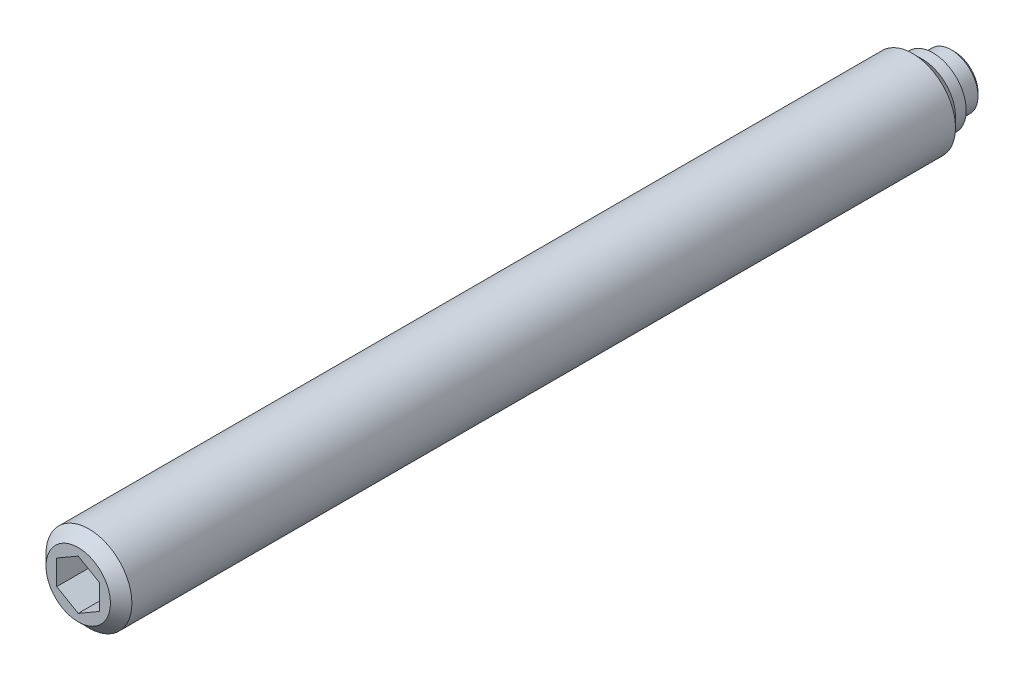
ISO-10303-21;
HEADER;
FILE_DESCRIPTION(('STEP AP214'),'2;1');
FILE_NAME('part.step','',(''),(''),'','','');
FILE_SCHEMA(('AUTOMOTIVE_DESIGN { 1 0 10303 214 1 1 1 1 }'));
ENDSEC;
DATA;
#1=APPLICATION_CONTEXT('core data for automotive mechanical design processes');
#2=APPLICATION_PROTOCOL_DEFINITION('international standard','automotive_design',2000,#1);
#3=PRODUCT_CONTEXT('',#1,'mechanical');
#4=PRODUCT('Part','Part','',(#3));
#5=PRODUCT_RELATED_PRODUCT_CATEGORY('part','',(#4));
#6=PRODUCT_DEFINITION_FORMATION('','',#4);
#7=PRODUCT_DEFINITION_CONTEXT('part definition',#1,'design');
#8=PRODUCT_DEFINITION('design','',#6,#7);
#9=PRODUCT_DEFINITION_SHAPE('','',#8);
#10=(LENGTH_UNIT() NAMED_UNIT(*) SI_UNIT(.MILLI.,.METRE.));
#11=(NAMED_UNIT(*) PLANE_ANGLE_UNIT() SI_UNIT($,.RADIAN.));
#12=(NAMED_UNIT(*) SI_UNIT($,.STERADIAN.) SOLID_ANGLE_UNIT());
#13=UNCERTAINTY_MEASURE_WITH_UNIT(LENGTH_MEASURE(1.E-05),#10,'distance_accuracy_value','');
#14=(GEOMETRIC_REPRESENTATION_CONTEXT(3) GLOBAL_UNCERTAINTY_ASSIGNED_CONTEXT((#13)) GLOBAL_UNIT_ASSIGNED_CONTEXT((#10,
#11,#12)) REPRESENTATION_CONTEXT('',''));
#15=CARTESIAN_POINT('',(0.,0.,0.));
#16=DIRECTION('',(0.,0.,1.));
#17=DIRECTION('',(1.,0.,0.));
#18=AXIS2_PLACEMENT_3D('',#15,#16,#17);
#19=CARTESIAN_POINT('',(0.,0.,0.));
#20=DIRECTION('',(0.,0.,-1.));
#21=DIRECTION('',(-1.,0.,0.));
#22=AXIS2_PLACEMENT_3D('',#19,#20,#21);
#23=CYLINDRICAL_SURFACE('',#22,2.5);
#24=CARTESIAN_POINT('',(0.,0.,0.3));
#25=DIRECTION('',(0.,0.,-1.));
#26=DIRECTION('',(-1.,0.,0.));
#27=AXIS2_PLACEMENT_3D('',#24,#25,#26);
#28=CIRCLE('',#27,2.5);
#29=CARTESIAN_POINT('',(-2.5,0.,0.3));
#30=VERTEX_POINT('',#29);
#31=EDGE_CURVE('E133',#30,#30,#28,.T.);
#32=ORIENTED_EDGE('',*,*,#31,.F.);
#33=EDGE_LOOP('',(#32));
#34=FACE_BOUND('',#33,.T.);
#35=CARTESIAN_POINT('',(0.,0.,2.));
#36=DIRECTION('',(0.,0.,-1.));
#37=DIRECTION('',(-1.,0.,0.));
#38=AXIS2_PLACEMENT_3D('',#35,#36,#37);
#39=CIRCLE('',#38,2.5);
#40=CARTESIAN_POINT('',(-2.5,0.,2.));
#41=VERTEX_POINT('',#40);
#42=EDGE_CURVE('E127',#41,#41,#39,.T.);
#43=ORIENTED_EDGE('',*,*,#42,.T.);
#44=EDGE_LOOP('',(#43));
#45=FACE_BOUND('',#44,.T.);
#46=ADVANCED_FACE('F14',(#34,#45),#23,.T.);
#47=CARTESIAN_POINT('',(0.,0.,0.3));
#48=DIRECTION('',(0.,0.,1.));
#49=DIRECTION('',(1.,0.,0.));
#50=AXIS2_PLACEMENT_3D('',#47,#48,#49);
#51=CONICAL_SURFACE('',#50,2.5,0.785398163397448);
#52=CARTESIAN_POINT('',(0.,0.,0.));
#53=DIRECTION('',(0.,0.,-1.));
#54=DIRECTION('',(-1.,0.,0.));
#55=AXIS2_PLACEMENT_3D('',#52,#53,#54);
#56=CIRCLE('',#55,2.2);
#57=CARTESIAN_POINT('',(-2.2,0.,0.));
#58=VERTEX_POINT('',#57);
#59=EDGE_CURVE('E130',#58,#58,#56,.T.);
#60=ORIENTED_EDGE('',*,*,#59,.F.);
#61=EDGE_LOOP('',(#60));
#62=FACE_BOUND('',#61,.T.);
#63=ORIENTED_EDGE('',*,*,#31,.T.);
#64=EDGE_LOOP('',(#63));
#65=FACE_BOUND('',#64,.T.);
#66=ADVANCED_FACE('F159',(#62,#65),#51,.T.);
#67=CARTESIAN_POINT('',(0.,2.2,0.));
#68=DIRECTION('',(0.,0.,1.));
#69=DIRECTION('',(1.,0.,0.));
#70=AXIS2_PLACEMENT_3D('',#67,#68,#69);
#71=PLANE('',#70);
#72=ORIENTED_EDGE('',*,*,#59,.T.);
#73=EDGE_LOOP('',(#72));
#74=FACE_BOUND('',#73,.T.);
#75=ADVANCED_FACE('F165',(#74),#71,.F.);
#76=CARTESIAN_POINT('',(0.,0.,2.));
#77=DIRECTION('',(0.,0.,-1.));
#78=DIRECTION('',(-1.,0.,0.));
#79=AXIS2_PLACEMENT_3D('',#76,#77,#78);
#80=CYLINDRICAL_SURFACE('',#79,4.);
#81=CARTESIAN_POINT('',(0.,0.,3.9));
#82=DIRECTION('',(0.,0.,-1.));
#83=DIRECTION('',(-1.,0.,0.));
#84=AXIS2_PLACEMENT_3D('',#81,#82,#83);
#85=CIRCLE('',#84,4.);
#86=CARTESIAN_POINT('',(-4.,0.,3.9));
#87=VERTEX_POINT('',#86);
#88=EDGE_CURVE('E9',#87,#87,#85,.T.);
#89=ORIENTED_EDGE('',*,*,#88,.F.);
#90=EDGE_LOOP('',(#89));
#91=FACE_BOUND('',#90,.T.);
#92=CARTESIAN_POINT('',(0.,0.,80.6));
#93=DIRECTION('',(0.,0.,1.));
#94=DIRECTION('',(1.,0.,0.));
#95=AXIS2_PLACEMENT_3D('',#92,#93,#94);
#96=CIRCLE('',#95,4.);
#97=CARTESIAN_POINT('',(4.,0.,80.6));
#98=VERTEX_POINT('',#97);
#99=EDGE_CURVE('E124',#98,#98,#96,.T.);
#100=ORIENTED_EDGE('',*,*,#99,.F.);
#101=EDGE_LOOP('',(#100));
#102=FACE_BOUND('',#101,.T.);
#103=ADVANCED_FACE('F16',(#91,#102),#80,.T.);
#104=CARTESIAN_POINT('',(0.,3.1,2.));
#105=DIRECTION('',(0.,0.,1.));
#106=DIRECTION('',(1.,0.,0.));
#107=AXIS2_PLACEMENT_3D('',#104,#105,#106);
#108=PLANE('',#107);
#109=CARTESIAN_POINT('',(0.,0.,2.));
#110=DIRECTION('',(0.,0.,-1.));
#111=DIRECTION('',(-1.,0.,0.));
#112=AXIS2_PLACEMENT_3D('',#109,#110,#111);
#113=CIRCLE('',#112,3.1);
#114=CARTESIAN_POINT('',(-3.1,0.,2.));
#115=VERTEX_POINT('',#114);
#116=EDGE_CURVE('E136',#115,#115,#113,.T.);
#117=ORIENTED_EDGE('',*,*,#116,.T.);
#118=EDGE_LOOP('',(#117));
#119=FACE_BOUND('',#118,.T.);
#120=ORIENTED_EDGE('',*,*,#42,.F.);
#121=EDGE_LOOP('',(#120));
#122=FACE_BOUND('',#121,.T.);
#123=ADVANCED_FACE('F156',(#119,#122),#108,.F.);
#124=CARTESIAN_POINT('',(0.,0.,2.));
#125=DIRECTION('',(0.,0.,-1.));
#126=DIRECTION('',(-1.,0.,0.));
#127=AXIS2_PLACEMENT_3D('',#124,#125,#126);
#128=CYLINDRICAL_SURFACE('',#127,3.1);
#129=CARTESIAN_POINT('',(0.,0.,3.));
#130=DIRECTION('',(0.,0.,-1.));
#131=DIRECTION('',(-1.,0.,0.));
#132=AXIS2_PLACEMENT_3D('',#129,#130,#131);
#133=CIRCLE('',#132,3.1);
#134=CARTESIAN_POINT('',(-3.1,0.,3.));
#135=VERTEX_POINT('',#134);
#136=EDGE_CURVE('E22',#135,#135,#133,.T.);
#137=ORIENTED_EDGE('',*,*,#136,.T.);
#138=EDGE_LOOP('',(#137));
#139=FACE_BOUND('',#138,.T.);
#140=ORIENTED_EDGE('',*,*,#116,.F.);
#141=EDGE_LOOP('',(#140));
#142=FACE_BOUND('',#141,.T.);
#143=ADVANCED_FACE('F141',(#139,#142),#128,.T.);
#144=CARTESIAN_POINT('',(0.,0.,3.9));
#145=DIRECTION('',(0.,0.,1.));
#146=DIRECTION('',(1.,0.,0.));
#147=AXIS2_PLACEMENT_3D('',#144,#145,#146);
#148=CONICAL_SURFACE('',#147,4.,0.78539816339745);
#149=ORIENTED_EDGE('',*,*,#88,.T.);
#150=EDGE_LOOP('',(#149));
#151=FACE_BOUND('',#150,.T.);
#152=ORIENTED_EDGE('',*,*,#136,.F.);
#153=EDGE_LOOP('',(#152));
#154=FACE_BOUND('',#153,.T.);
#155=ADVANCED_FACE('F144',(#151,#154),#148,.T.);
#156=CARTESIAN_POINT('',(0.,-3.,81.6));
#157=DIRECTION('',(0.,0.,1.));
#158=DIRECTION('',(1.,0.,0.));
#159=AXIS2_PLACEMENT_3D('',#156,#157,#158);
#160=PLANE('',#159);
#161=DIRECTION('',(0.866025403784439,-0.5,0.));
#162=VECTOR('',#161,1.);
#163=CARTESIAN_POINT('',(-2.,-1.15470053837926,81.6));
#164=LINE('',#163,#162);
#165=CARTESIAN_POINT('',(-2.,-1.15470053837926,81.6));
#166=VERTEX_POINT('',#165);
#167=CARTESIAN_POINT('',(0.,-2.30940107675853,81.6));
#168=VERTEX_POINT('',#167);
#169=EDGE_CURVE('E29',#166,#168,#164,.T.);
#170=ORIENTED_EDGE('',*,*,#169,.F.);
#171=DIRECTION('',(0.,-1.,0.));
#172=VECTOR('',#171,1.);
#173=CARTESIAN_POINT('',(-2.,1.15470053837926,81.6));
#174=LINE('',#173,#172);
#175=CARTESIAN_POINT('',(-2.,1.15470053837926,81.6));
#176=VERTEX_POINT('',#175);
#177=EDGE_CURVE('E112',#176,#166,#174,.T.);
#178=ORIENTED_EDGE('',*,*,#177,.F.);
#179=DIRECTION('',(-0.866025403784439,-0.5,0.));
#180=VECTOR('',#179,1.);
#181=CARTESIAN_POINT('',(0.,2.30940107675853,81.6));
#182=LINE('',#181,#180);
#183=CARTESIAN_POINT('',(0.,2.30940107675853,81.6));
#184=VERTEX_POINT('',#183);
#185=EDGE_CURVE('E110',#184,#176,#182,.T.);
#186=ORIENTED_EDGE('',*,*,#185,.F.);
#187=DIRECTION('',(-0.866025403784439,0.5,0.));
#188=VECTOR('',#187,1.);
#189=CARTESIAN_POINT('',(2.,1.15470053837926,81.6));
#190=LINE('',#189,#188);
#191=CARTESIAN_POINT('',(2.,1.15470053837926,81.6));
#192=VERTEX_POINT('',#191);
#193=EDGE_CURVE('E77',#192,#184,#190,.T.);
#194=ORIENTED_EDGE('',*,*,#193,.F.);
#195=DIRECTION('',(0.,1.,0.));
#196=VECTOR('',#195,1.);
#197=CARTESIAN_POINT('',(2.,-1.15470053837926,81.6));
#198=LINE('',#197,#196);
#199=CARTESIAN_POINT('',(2.,-1.15470053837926,81.6));
#200=VERTEX_POINT('',#199);
#201=EDGE_CURVE('E106',#200,#192,#198,.T.);
#202=ORIENTED_EDGE('',*,*,#201,.F.);
#203=DIRECTION('',(0.866025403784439,0.5,0.));
#204=VECTOR('',#203,1.);
#205=CARTESIAN_POINT('',(0.,-2.30940107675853,81.6));
#206=LINE('',#205,#204);
#207=EDGE_CURVE('E103',#168,#200,#206,.T.);
#208=ORIENTED_EDGE('',*,*,#207,.F.);
#209=EDGE_LOOP('',(#170,#178,#186,#194,#202,#208));
#210=FACE_BOUND('',#209,.T.);
#211=CARTESIAN_POINT('',(0.,0.,81.6));
#212=DIRECTION('',(0.,0.,1.));
#213=DIRECTION('',(1.,0.,0.));
#214=AXIS2_PLACEMENT_3D('',#211,#212,#213);
#215=CIRCLE('',#214,3.);
#216=CARTESIAN_POINT('',(3.,0.,81.6));
#217=VERTEX_POINT('',#216);
#218=EDGE_CURVE('E116',#217,#217,#215,.T.);
#219=ORIENTED_EDGE('',*,*,#218,.T.);
#220=EDGE_LOOP('',(#219));
#221=FACE_BOUND('',#220,.T.);
#222=ADVANCED_FACE('F146',(#210,#221),#160,.T.);
#223=CARTESIAN_POINT('',(0.,0.,81.6));
#224=DIRECTION('',(0.,0.,-1.));
#225=DIRECTION('',(-1.,0.,0.));
#226=AXIS2_PLACEMENT_3D('',#223,#224,#225);
#227=CONICAL_SURFACE('',#226,3.,0.785398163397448);
#228=ORIENTED_EDGE('',*,*,#99,.T.);
#229=EDGE_LOOP('',(#228));
#230=FACE_BOUND('',#229,.T.);
#231=ORIENTED_EDGE('',*,*,#218,.F.);
#232=EDGE_LOOP('',(#231));
#233=FACE_BOUND('',#232,.T.);
#234=ADVANCED_FACE('F153',(#230,#233),#227,.T.);
#235=CARTESIAN_POINT('',(-2.,-1.15470053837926,76.6));
#236=DIRECTION('',(-0.5,-0.866025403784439,0.));
#237=DIRECTION('',(0.866025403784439,-0.5,0.));
#238=AXIS2_PLACEMENT_3D('',#235,#236,#237);
#239=PLANE('',#238);
#240=ORIENTED_EDGE('',*,*,#169,.T.);
#241=DIRECTION('',(0.,0.,1.));
#242=VECTOR('',#241,1.);
#243=CARTESIAN_POINT('',(0.,-2.30940107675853,76.6));
#244=LINE('',#243,#242);
#245=CARTESIAN_POINT('',(0.,-2.30940107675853,76.6));
#246=VERTEX_POINT('',#245);
#247=EDGE_CURVE('E59',#246,#168,#244,.T.);
#248=ORIENTED_EDGE('',*,*,#247,.F.);
#249=DIRECTION('',(0.866025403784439,-0.5,0.));
#250=VECTOR('',#249,1.);
#251=CARTESIAN_POINT('',(-2.,-1.15470053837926,76.6));
#252=LINE('',#251,#250);
#253=CARTESIAN_POINT('',(-2.,-1.15470053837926,76.6));
#254=VERTEX_POINT('',#253);
#255=EDGE_CURVE('E114',#254,#246,#252,.T.);
#256=ORIENTED_EDGE('',*,*,#255,.F.);
#257=DIRECTION('',(0.,0.,1.));
#258=VECTOR('',#257,1.);
#259=CARTESIAN_POINT('',(-2.,-1.15470053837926,76.6));
#260=LINE('',#259,#258);
#261=EDGE_CURVE('E37',#254,#166,#260,.T.);
#262=ORIENTED_EDGE('',*,*,#261,.T.);
#263=EDGE_LOOP('',(#240,#248,#256,#262));
#264=FACE_BOUND('',#263,.T.);
#265=ADVANCED_FACE('F191',(#264),#239,.F.);
#266=CARTESIAN_POINT('',(-2.,1.15470053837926,76.6));
#267=DIRECTION('',(-1.,0.,0.));
#268=DIRECTION('',(0.,0.,1.));
#269=AXIS2_PLACEMENT_3D('',#266,#267,#268);
#270=PLANE('',#269);
#271=ORIENTED_EDGE('',*,*,#177,.T.);
#272=ORIENTED_EDGE('',*,*,#261,.F.);
#273=DIRECTION('',(0.,-1.,0.));
#274=VECTOR('',#273,1.);
#275=CARTESIAN_POINT('',(-2.,1.15470053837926,76.6));
#276=LINE('',#275,#274);
#277=CARTESIAN_POINT('',(-2.,1.15470053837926,76.6));
#278=VERTEX_POINT('',#277);
#279=EDGE_CURVE('E89',#278,#254,#276,.T.);
#280=ORIENTED_EDGE('',*,*,#279,.F.);
#281=DIRECTION('',(0.,0.,1.));
#282=VECTOR('',#281,1.);
#283=CARTESIAN_POINT('',(-2.,1.15470053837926,76.6));
#284=LINE('',#283,#282);
#285=EDGE_CURVE('E81',#278,#176,#284,.T.);
#286=ORIENTED_EDGE('',*,*,#285,.T.);
#287=EDGE_LOOP('',(#271,#272,#280,#286));
#288=FACE_BOUND('',#287,.T.);
#289=ADVANCED_FACE('F198',(#288),#270,.F.);
#290=CARTESIAN_POINT('',(0.,2.30940107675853,76.6));
#291=DIRECTION('',(-0.5,0.866025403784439,0.));
#292=DIRECTION('',(-0.866025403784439,-0.5,0.));
#293=AXIS2_PLACEMENT_3D('',#290,#291,#292);
#294=PLANE('',#293);
#295=ORIENTED_EDGE('',*,*,#185,.T.);
#296=ORIENTED_EDGE('',*,*,#285,.F.);
#297=DIRECTION('',(-0.866025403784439,-0.5,0.));
#298=VECTOR('',#297,1.);
#299=CARTESIAN_POINT('',(0.,2.30940107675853,76.6));
#300=LINE('',#299,#298);
#301=CARTESIAN_POINT('',(0.,2.30940107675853,76.6));
#302=VERTEX_POINT('',#301);
#303=EDGE_CURVE('E85',#302,#278,#300,.T.);
#304=ORIENTED_EDGE('',*,*,#303,.F.);
#305=DIRECTION('',(0.,0.,1.));
#306=VECTOR('',#305,1.);
#307=CARTESIAN_POINT('',(0.,2.30940107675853,76.6));
#308=LINE('',#307,#306);
#309=EDGE_CURVE('E70',#302,#184,#308,.T.);
#310=ORIENTED_EDGE('',*,*,#309,.T.);
#311=EDGE_LOOP('',(#295,#296,#304,#310));
#312=FACE_BOUND('',#311,.T.);
#313=ADVANCED_FACE('F86',(#312),#294,.F.);
#314=CARTESIAN_POINT('',(2.,1.15470053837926,76.6));
#315=DIRECTION('',(0.5,0.866025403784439,0.));
#316=DIRECTION('',(-0.866025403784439,0.5,0.));
#317=AXIS2_PLACEMENT_3D('',#314,#315,#316);
#318=PLANE('',#317);
#319=ORIENTED_EDGE('',*,*,#193,.T.);
#320=ORIENTED_EDGE('',*,*,#309,.F.);
#321=DIRECTION('',(-0.866025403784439,0.5,0.));
#322=VECTOR('',#321,1.);
#323=CARTESIAN_POINT('',(2.,1.15470053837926,76.6));
#324=LINE('',#323,#322);
#325=CARTESIAN_POINT('',(2.,1.15470053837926,76.6));
#326=VERTEX_POINT('',#325);
#327=EDGE_CURVE('E74',#326,#302,#324,.T.);
#328=ORIENTED_EDGE('',*,*,#327,.F.);
#329=DIRECTION('',(0.,0.,1.));
#330=VECTOR('',#329,1.);
#331=CARTESIAN_POINT('',(2.,1.15470053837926,76.6));
#332=LINE('',#331,#330);
#333=EDGE_CURVE('E82',#326,#192,#332,.T.);
#334=ORIENTED_EDGE('',*,*,#333,.T.);
#335=EDGE_LOOP('',(#319,#320,#328,#334));
#336=FACE_BOUND('',#335,.T.);
#337=ADVANCED_FACE('F72',(#336),#318,.F.);
#338=CARTESIAN_POINT('',(2.,-1.15470053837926,76.6));
#339=DIRECTION('',(1.,0.,0.));
#340=DIRECTION('',(0.,0.,-1.));
#341=AXIS2_PLACEMENT_3D('',#338,#339,#340);
#342=PLANE('',#341);
#343=ORIENTED_EDGE('',*,*,#201,.T.);
#344=ORIENTED_EDGE('',*,*,#333,.F.);
#345=DIRECTION('',(0.,1.,0.));
#346=VECTOR('',#345,1.);
#347=CARTESIAN_POINT('',(2.,-1.15470053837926,76.6));
#348=LINE('',#347,#346);
#349=CARTESIAN_POINT('',(2.,-1.15470053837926,76.6));
#350=VERTEX_POINT('',#349);
#351=EDGE_CURVE('E95',#350,#326,#348,.T.);
#352=ORIENTED_EDGE('',*,*,#351,.F.);
#353=DIRECTION('',(0.,0.,1.));
#354=VECTOR('',#353,1.);
#355=CARTESIAN_POINT('',(2.,-1.15470053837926,76.6));
#356=LINE('',#355,#354);
#357=EDGE_CURVE('E119',#350,#200,#356,.T.);
#358=ORIENTED_EDGE('',*,*,#357,.T.);
#359=EDGE_LOOP('',(#343,#344,#352,#358));
#360=FACE_BOUND('',#359,.T.);
#361=ADVANCED_FACE('F204',(#360),#342,.F.);
#362=CARTESIAN_POINT('',(0.,-2.30940107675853,76.6));
#363=DIRECTION('',(0.5,-0.866025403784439,0.));
#364=DIRECTION('',(0.866025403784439,0.5,0.));
#365=AXIS2_PLACEMENT_3D('',#362,#363,#364);
#366=PLANE('',#365);
#367=ORIENTED_EDGE('',*,*,#207,.T.);
#368=ORIENTED_EDGE('',*,*,#357,.F.);
#369=DIRECTION('',(0.866025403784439,0.5,0.));
#370=VECTOR('',#369,1.);
#371=CARTESIAN_POINT('',(0.,-2.30940107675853,76.6));
#372=LINE('',#371,#370);
#373=EDGE_CURVE('E97',#246,#350,#372,.T.);
#374=ORIENTED_EDGE('',*,*,#373,.F.);
#375=ORIENTED_EDGE('',*,*,#247,.T.);
#376=EDGE_LOOP('',(#367,#368,#374,#375));
#377=FACE_BOUND('',#376,.T.);
#378=ADVANCED_FACE('F201',(#377),#366,.F.);
#379=CARTESIAN_POINT('',(0.,0.,76.6));
#380=DIRECTION('',(0.,0.,1.));
#381=DIRECTION('',(1.,0.,0.));
#382=AXIS2_PLACEMENT_3D('',#379,#380,#381);
#383=PLANE('',#382);
#384=ORIENTED_EDGE('',*,*,#255,.T.);
#385=ORIENTED_EDGE('',*,*,#373,.T.);
#386=ORIENTED_EDGE('',*,*,#351,.T.);
#387=ORIENTED_EDGE('',*,*,#327,.T.);
#388=ORIENTED_EDGE('',*,*,#303,.T.);
#389=ORIENTED_EDGE('',*,*,#279,.T.);
#390=EDGE_LOOP('',(#384,#385,#386,#387,#388,#389));
#391=FACE_BOUND('',#390,.T.);
#392=ADVANCED_FACE('F92',(#391),#383,.T.);
#393=CLOSED_SHELL('',(#46,#66,#75,#103,#123,#143,#155,#222,#234,#265,#289,#313,#337,#361,#378,#392));
#394=MANIFOLD_SOLID_BREP('B1',#393);
#395=ADVANCED_BREP_SHAPE_REPRESENTATION('',(#18,#394),#14);
#396=SHAPE_DEFINITION_REPRESENTATION(#9,#395);
ENDSEC;
END-ISO-10303-21;
